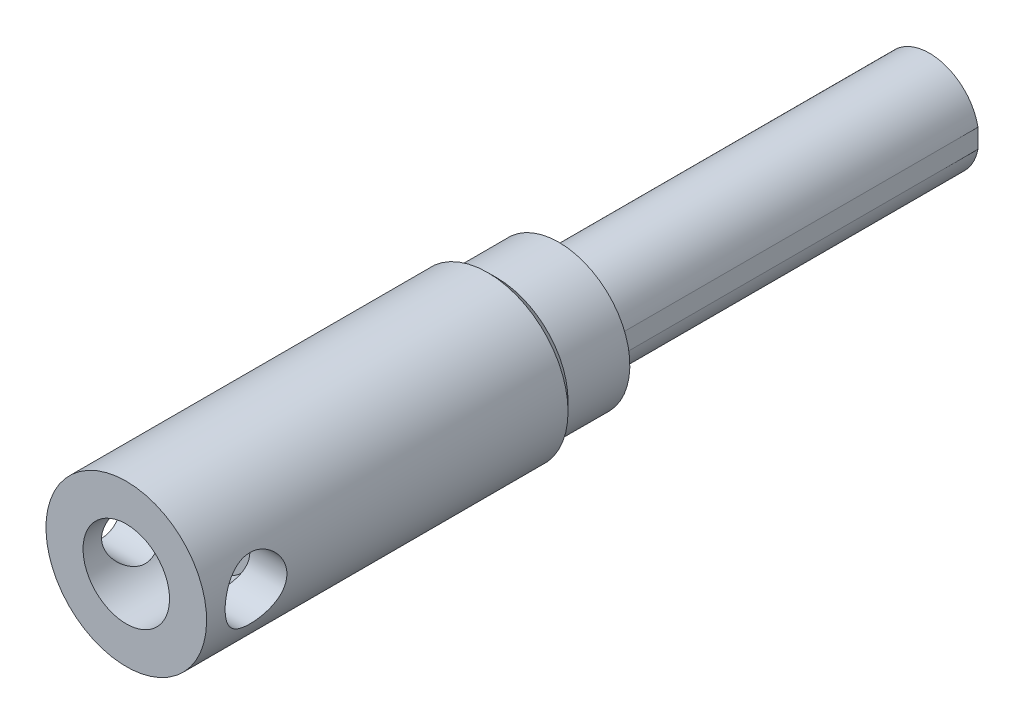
ISO-10303-21;
HEADER;
FILE_DESCRIPTION(('STEP AP214'),'2;1');
FILE_NAME('part.step','',(''),(''),'','','');
FILE_SCHEMA(('AUTOMOTIVE_DESIGN { 1 0 10303 214 1 1 1 1 }'));
ENDSEC;
DATA;
#1=APPLICATION_CONTEXT('core data for automotive mechanical design processes');
#2=APPLICATION_PROTOCOL_DEFINITION('international standard','automotive_design',2000,#1);
#3=PRODUCT_CONTEXT('',#1,'mechanical');
#4=PRODUCT('Part','Part','',(#3));
#5=PRODUCT_RELATED_PRODUCT_CATEGORY('part','',(#4));
#6=PRODUCT_DEFINITION_FORMATION('','',#4);
#7=PRODUCT_DEFINITION_CONTEXT('part definition',#1,'design');
#8=PRODUCT_DEFINITION('design','',#6,#7);
#9=PRODUCT_DEFINITION_SHAPE('','',#8);
#10=(LENGTH_UNIT() NAMED_UNIT(*) SI_UNIT(.MILLI.,.METRE.));
#11=(NAMED_UNIT(*) PLANE_ANGLE_UNIT() SI_UNIT($,.RADIAN.));
#12=(NAMED_UNIT(*) SI_UNIT($,.STERADIAN.) SOLID_ANGLE_UNIT());
#13=UNCERTAINTY_MEASURE_WITH_UNIT(LENGTH_MEASURE(1.E-05),#10,'distance_accuracy_value','');
#14=(GEOMETRIC_REPRESENTATION_CONTEXT(3) GLOBAL_UNCERTAINTY_ASSIGNED_CONTEXT((#13)) GLOBAL_UNIT_ASSIGNED_CONTEXT((#10,
#11,#12)) REPRESENTATION_CONTEXT('',''));
#15=CARTESIAN_POINT('',(0.,0.,0.));
#16=DIRECTION('',(0.,0.,1.));
#17=DIRECTION('',(1.,0.,0.));
#18=AXIS2_PLACEMENT_3D('',#15,#16,#17);
#19=CARTESIAN_POINT('',(-3.46410161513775,0.,112.));
#20=DIRECTION('',(0.866025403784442,-0.5,0.));
#21=DIRECTION('',(0.5,0.866025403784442,0.));
#22=AXIS2_PLACEMENT_3D('',#19,#20,#21);
#23=PLANE('',#22);
#24=DIRECTION('',(0.,0.,1.));
#25=VECTOR('',#24,1.);
#26=CARTESIAN_POINT('',(-1.73205080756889,3.,112.));
#27=LINE('',#26,#25);
#28=CARTESIAN_POINT('',(-1.73205080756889,3.,112.));
#29=VERTEX_POINT('',#28);
#30=CARTESIAN_POINT('',(-1.73205080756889,3.,116.));
#31=VERTEX_POINT('',#30);
#32=EDGE_CURVE('E291',#29,#31,#27,.T.);
#33=ORIENTED_EDGE('',*,*,#32,.T.);
#34=DIRECTION('',(0.5,0.866025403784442,0.));
#35=VECTOR('',#34,1.);
#36=CARTESIAN_POINT('',(-3.46410161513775,0.,116.));
#37=LINE('',#36,#35);
#38=CARTESIAN_POINT('',(-3.46410161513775,0.,116.));
#39=VERTEX_POINT('',#38);
#40=EDGE_CURVE('E29',#39,#31,#37,.T.);
#41=ORIENTED_EDGE('',*,*,#40,.F.);
#42=DIRECTION('',(0.,0.,1.));
#43=VECTOR('',#42,1.);
#44=CARTESIAN_POINT('',(-3.46410161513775,0.,112.));
#45=LINE('',#44,#43);
#46=CARTESIAN_POINT('',(-3.46410161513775,0.,112.));
#47=VERTEX_POINT('',#46);
#48=EDGE_CURVE('E33',#47,#39,#45,.T.);
#49=ORIENTED_EDGE('',*,*,#48,.F.);
#50=DIRECTION('',(0.5,0.866025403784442,0.));
#51=VECTOR('',#50,1.);
#52=CARTESIAN_POINT('',(-3.46410161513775,0.,112.));
#53=LINE('',#52,#51);
#54=EDGE_CURVE('E252',#47,#29,#53,.T.);
#55=ORIENTED_EDGE('',*,*,#54,.T.);
#56=EDGE_LOOP('',(#33,#41,#49,#55));
#57=FACE_BOUND('',#56,.T.);
#58=ADVANCED_FACE('F14',(#57),#23,.T.);
#59=CARTESIAN_POINT('',(1.73205080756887,3.,112.));
#60=DIRECTION('',(0.,1.,0.));
#61=DIRECTION('',(0.,0.,-1.));
#62=AXIS2_PLACEMENT_3D('',#59,#60,#61);
#63=PLANE('',#62);
#64=DIRECTION('',(0.,0.,1.));
#65=VECTOR('',#64,1.);
#66=CARTESIAN_POINT('',(1.73205080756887,3.,112.));
#67=LINE('',#66,#65);
#68=CARTESIAN_POINT('',(1.73205080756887,3.,112.));
#69=VERTEX_POINT('',#68);
#70=CARTESIAN_POINT('',(1.73205080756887,3.,116.));
#71=VERTEX_POINT('',#70);
#72=EDGE_CURVE('E289',#69,#71,#67,.T.);
#73=ORIENTED_EDGE('',*,*,#72,.T.);
#74=DIRECTION('',(-1.,0.,0.));
#75=VECTOR('',#74,1.);
#76=CARTESIAN_POINT('',(1.73205080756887,3.,116.));
#77=LINE('',#76,#75);
#78=EDGE_CURVE('E262',#71,#31,#77,.T.);
#79=ORIENTED_EDGE('',*,*,#78,.T.);
#80=ORIENTED_EDGE('',*,*,#32,.F.);
#81=DIRECTION('',(-1.,0.,0.));
#82=VECTOR('',#81,1.);
#83=CARTESIAN_POINT('',(1.73205080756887,3.,112.));
#84=LINE('',#83,#82);
#85=EDGE_CURVE('E278',#69,#29,#84,.T.);
#86=ORIENTED_EDGE('',*,*,#85,.F.);
#87=EDGE_LOOP('',(#73,#79,#80,#86));
#88=FACE_BOUND('',#87,.T.);
#89=ADVANCED_FACE('F166',(#88),#63,.F.);
#90=CARTESIAN_POINT('',(3.46410161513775,0.,112.));
#91=DIRECTION('',(0.866025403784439,0.5,0.));
#92=DIRECTION('',(-0.5,0.866025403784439,0.));
#93=AXIS2_PLACEMENT_3D('',#90,#91,#92);
#94=PLANE('',#93);
#95=DIRECTION('',(0.,0.,1.));
#96=VECTOR('',#95,1.);
#97=CARTESIAN_POINT('',(3.46410161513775,0.,112.));
#98=LINE('',#97,#96);
#99=CARTESIAN_POINT('',(3.46410161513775,0.,112.));
#100=VERTEX_POINT('',#99);
#101=CARTESIAN_POINT('',(3.46410161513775,0.,116.));
#102=VERTEX_POINT('',#101);
#103=EDGE_CURVE('E287',#100,#102,#98,.T.);
#104=ORIENTED_EDGE('',*,*,#103,.T.);
#105=DIRECTION('',(-0.5,0.866025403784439,0.));
#106=VECTOR('',#105,1.);
#107=CARTESIAN_POINT('',(3.46410161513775,0.,116.));
#108=LINE('',#107,#106);
#109=EDGE_CURVE('E259',#102,#71,#108,.T.);
#110=ORIENTED_EDGE('',*,*,#109,.T.);
#111=ORIENTED_EDGE('',*,*,#72,.F.);
#112=DIRECTION('',(-0.5,0.866025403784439,0.));
#113=VECTOR('',#112,1.);
#114=CARTESIAN_POINT('',(3.46410161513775,0.,112.));
#115=LINE('',#114,#113);
#116=EDGE_CURVE('E275',#100,#69,#115,.T.);
#117=ORIENTED_EDGE('',*,*,#116,.F.);
#118=EDGE_LOOP('',(#104,#110,#111,#117));
#119=FACE_BOUND('',#118,.T.);
#120=ADVANCED_FACE('F171',(#119),#94,.F.);
#121=CARTESIAN_POINT('',(3.46410161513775,0.,112.));
#122=DIRECTION('',(-0.866025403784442,0.5,0.));
#123=DIRECTION('',(-0.5,-0.866025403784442,0.));
#124=AXIS2_PLACEMENT_3D('',#121,#122,#123);
#125=PLANE('',#124);
#126=DIRECTION('',(0.,0.,1.));
#127=VECTOR('',#126,1.);
#128=CARTESIAN_POINT('',(1.73205080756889,-3.,112.));
#129=LINE('',#128,#127);
#130=CARTESIAN_POINT('',(1.73205080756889,-3.,112.));
#131=VERTEX_POINT('',#130);
#132=CARTESIAN_POINT('',(1.73205080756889,-3.,116.));
#133=VERTEX_POINT('',#132);
#134=EDGE_CURVE('E285',#131,#133,#129,.T.);
#135=ORIENTED_EDGE('',*,*,#134,.T.);
#136=DIRECTION('',(-0.5,-0.866025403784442,0.));
#137=VECTOR('',#136,1.);
#138=CARTESIAN_POINT('',(3.46410161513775,0.,116.));
#139=LINE('',#138,#137);
#140=EDGE_CURVE('E256',#102,#133,#139,.T.);
#141=ORIENTED_EDGE('',*,*,#140,.F.);
#142=ORIENTED_EDGE('',*,*,#103,.F.);
#143=DIRECTION('',(-0.5,-0.866025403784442,0.));
#144=VECTOR('',#143,1.);
#145=CARTESIAN_POINT('',(3.46410161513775,0.,112.));
#146=LINE('',#145,#144);
#147=EDGE_CURVE('E272',#100,#131,#146,.T.);
#148=ORIENTED_EDGE('',*,*,#147,.T.);
#149=EDGE_LOOP('',(#135,#141,#142,#148));
#150=FACE_BOUND('',#149,.T.);
#151=ADVANCED_FACE('F184',(#150),#125,.T.);
#152=CARTESIAN_POINT('',(-1.73205080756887,-3.,112.));
#153=DIRECTION('',(0.,-1.,0.));
#154=DIRECTION('',(1.,0.,0.));
#155=AXIS2_PLACEMENT_3D('',#152,#153,#154);
#156=PLANE('',#155);
#157=DIRECTION('',(0.,0.,1.));
#158=VECTOR('',#157,1.);
#159=CARTESIAN_POINT('',(-1.73205080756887,-3.,112.));
#160=LINE('',#159,#158);
#161=CARTESIAN_POINT('',(-1.73205080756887,-3.,112.));
#162=VERTEX_POINT('',#161);
#163=CARTESIAN_POINT('',(-1.73205080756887,-3.,116.));
#164=VERTEX_POINT('',#163);
#165=EDGE_CURVE('E283',#162,#164,#160,.T.);
#166=ORIENTED_EDGE('',*,*,#165,.T.);
#167=DIRECTION('',(1.,0.,0.));
#168=VECTOR('',#167,1.);
#169=CARTESIAN_POINT('',(-1.73205080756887,-3.,116.));
#170=LINE('',#169,#168);
#171=EDGE_CURVE('E253',#164,#133,#170,.T.);
#172=ORIENTED_EDGE('',*,*,#171,.T.);
#173=ORIENTED_EDGE('',*,*,#134,.F.);
#174=DIRECTION('',(1.,0.,0.));
#175=VECTOR('',#174,1.);
#176=CARTESIAN_POINT('',(-1.73205080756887,-3.,112.));
#177=LINE('',#176,#175);
#178=EDGE_CURVE('E269',#162,#131,#177,.T.);
#179=ORIENTED_EDGE('',*,*,#178,.F.);
#180=EDGE_LOOP('',(#166,#172,#173,#179));
#181=FACE_BOUND('',#180,.T.);
#182=ADVANCED_FACE('F180',(#181),#156,.F.);
#183=CARTESIAN_POINT('',(-3.46410161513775,0.,112.));
#184=DIRECTION('',(-0.866025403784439,-0.5,0.));
#185=DIRECTION('',(0.5,-0.866025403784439,0.));
#186=AXIS2_PLACEMENT_3D('',#183,#184,#185);
#187=PLANE('',#186);
#188=DIRECTION('',(0.5,-0.866025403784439,0.));
#189=VECTOR('',#188,1.);
#190=CARTESIAN_POINT('',(-3.46410161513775,0.,112.));
#191=LINE('',#190,#189);
#192=EDGE_CURVE('E266',#47,#162,#191,.T.);
#193=ORIENTED_EDGE('',*,*,#192,.F.);
#194=ORIENTED_EDGE('',*,*,#48,.T.);
#195=DIRECTION('',(0.5,-0.866025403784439,0.));
#196=VECTOR('',#195,1.);
#197=CARTESIAN_POINT('',(-3.46410161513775,0.,116.));
#198=LINE('',#197,#196);
#199=EDGE_CURVE('E249',#39,#164,#198,.T.);
#200=ORIENTED_EDGE('',*,*,#199,.T.);
#201=ORIENTED_EDGE('',*,*,#165,.F.);
#202=EDGE_LOOP('',(#193,#194,#200,#201));
#203=FACE_BOUND('',#202,.T.);
#204=ADVANCED_FACE('F177',(#203),#187,.F.);
#205=CARTESIAN_POINT('',(-5.19615242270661,-3.,112.));
#206=DIRECTION('',(0.,0.,-1.));
#207=DIRECTION('',(0.,-1.,0.));
#208=AXIS2_PLACEMENT_3D('',#205,#206,#207);
#209=PLANE('',#208);
#210=ORIENTED_EDGE('',*,*,#54,.F.);
#211=ORIENTED_EDGE('',*,*,#192,.T.);
#212=ORIENTED_EDGE('',*,*,#178,.T.);
#213=ORIENTED_EDGE('',*,*,#147,.F.);
#214=ORIENTED_EDGE('',*,*,#116,.T.);
#215=ORIENTED_EDGE('',*,*,#85,.T.);
#216=EDGE_LOOP('',(#210,#211,#212,#213,#214,#215));
#217=FACE_BOUND('',#216,.T.);
#218=ADVANCED_FACE('F176',(#217),#209,.F.);
#219=CARTESIAN_POINT('',(0.,0.,116.));
#220=DIRECTION('',(0.,0.,1.));
#221=DIRECTION('',(0.,1.,0.));
#222=AXIS2_PLACEMENT_3D('',#219,#220,#221);
#223=PLANE('',#222);
#224=CARTESIAN_POINT('',(0.,0.,116.));
#225=DIRECTION('',(0.,0.,1.));
#226=DIRECTION('',(0.,1.,0.));
#227=AXIS2_PLACEMENT_3D('',#224,#225,#226);
#228=CIRCLE('',#227,6.5);
#229=CARTESIAN_POINT('',(0.,6.5,116.));
#230=VERTEX_POINT('',#229);
#231=EDGE_CURVE('E9',#230,#230,#228,.T.);
#232=ORIENTED_EDGE('',*,*,#231,.T.);
#233=EDGE_LOOP('',(#232));
#234=FACE_BOUND('',#233,.T.);
#235=ORIENTED_EDGE('',*,*,#199,.F.);
#236=ORIENTED_EDGE('',*,*,#40,.T.);
#237=ORIENTED_EDGE('',*,*,#78,.F.);
#238=ORIENTED_EDGE('',*,*,#109,.F.);
#239=ORIENTED_EDGE('',*,*,#140,.T.);
#240=ORIENTED_EDGE('',*,*,#171,.F.);
#241=EDGE_LOOP('',(#235,#236,#237,#238,#239,#240));
#242=FACE_BOUND('',#241,.T.);
#243=ADVANCED_FACE('F16',(#234,#242),#223,.T.);
#244=CARTESIAN_POINT('',(0.,0.,88.));
#245=DIRECTION('',(0.,0.,1.));
#246=DIRECTION('',(0.,1.,0.));
#247=AXIS2_PLACEMENT_3D('',#244,#245,#246);
#248=CYLINDRICAL_SURFACE('',#247,6.5);
#249=CARTESIAN_POINT('',(0.,0.,108.));
#250=DIRECTION('',(0.,0.,1.));
#251=DIRECTION('',(0.,1.,0.));
#252=AXIS2_PLACEMENT_3D('',#249,#250,#251);
#253=CIRCLE('',#252,6.5);
#254=CARTESIAN_POINT('',(0.,6.5,108.));
#255=VERTEX_POINT('',#254);
#256=EDGE_CURVE('E22',#255,#255,#253,.T.);
#257=ORIENTED_EDGE('',*,*,#256,.T.);
#258=EDGE_LOOP('',(#257));
#259=FACE_BOUND('',#258,.T.);
#260=ORIENTED_EDGE('',*,*,#231,.F.);
#261=EDGE_LOOP('',(#260));
#262=FACE_BOUND('',#261,.T.);
#263=ADVANCED_FACE('F191',(#259,#262),#248,.T.);
#264=CARTESIAN_POINT('',(0.,0.,0.));
#265=DIRECTION('',(0.,0.,1.));
#266=DIRECTION('',(-1.,0.,0.));
#267=AXIS2_PLACEMENT_3D('',#264,#265,#266);
#268=PLANE('',#267);
#269=DIRECTION('',(0.,-1.,0.));
#270=VECTOR('',#269,1.);
#271=CARTESIAN_POINT('',(7.85,-1.54191439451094,0.));
#272=LINE('',#271,#270);
#273=CARTESIAN_POINT('',(7.85,1.54191439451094,0.));
#274=VERTEX_POINT('',#273);
#275=CARTESIAN_POINT('',(7.85,-1.54191439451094,0.));
#276=VERTEX_POINT('',#275);
#277=EDGE_CURVE('E91',#274,#276,#272,.T.);
#278=ORIENTED_EDGE('',*,*,#277,.T.);
#279=CARTESIAN_POINT('',(0.,0.,0.));
#280=DIRECTION('',(0.,0.,1.));
#281=DIRECTION('',(-1.,0.,0.));
#282=AXIS2_PLACEMENT_3D('',#279,#280,#281);
#283=CIRCLE('',#282,8.);
#284=EDGE_CURVE('E83',#274,#276,#283,.T.);
#285=ORIENTED_EDGE('',*,*,#284,.F.);
#286=EDGE_LOOP('',(#278,#285));
#287=FACE_BOUND('',#286,.T.);
#288=ADVANCED_FACE('F95',(#287),#268,.F.);
#289=CARTESIAN_POINT('',(7.85,-1.54191439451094,80.));
#290=DIRECTION('',(1.,0.,0.));
#291=DIRECTION('',(0.,0.,1.));
#292=AXIS2_PLACEMENT_3D('',#289,#290,#291);
#293=PLANE('',#292);
#294=DIRECTION('',(0.,1.,0.));
#295=VECTOR('',#294,1.);
#296=CARTESIAN_POINT('',(7.85,11.5,60.));
#297=LINE('',#296,#295);
#298=CARTESIAN_POINT('',(7.85,-1.54191439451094,60.));
#299=VERTEX_POINT('',#298);
#300=CARTESIAN_POINT('',(7.85,1.54191439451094,60.));
#301=VERTEX_POINT('',#300);
#302=EDGE_CURVE('E246',#299,#301,#297,.T.);
#303=ORIENTED_EDGE('',*,*,#302,.F.);
#304=DIRECTION('',(0.,0.,-1.));
#305=VECTOR('',#304,1.);
#306=CARTESIAN_POINT('',(7.85,-1.54191439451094,80.));
#307=LINE('',#306,#305);
#308=EDGE_CURVE('E88',#299,#276,#307,.T.);
#309=ORIENTED_EDGE('',*,*,#308,.T.);
#310=ORIENTED_EDGE('',*,*,#277,.F.);
#311=DIRECTION('',(0.,0.,-1.));
#312=VECTOR('',#311,1.);
#313=CARTESIAN_POINT('',(7.85,1.54191439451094,80.));
#314=LINE('',#313,#312);
#315=EDGE_CURVE('E78',#301,#274,#314,.T.);
#316=ORIENTED_EDGE('',*,*,#315,.F.);
#317=EDGE_LOOP('',(#303,#309,#310,#316));
#318=FACE_BOUND('',#317,.T.);
#319=ADVANCED_FACE('F92',(#318),#293,.T.);
#320=CARTESIAN_POINT('',(0.,0.,80.));
#321=DIRECTION('',(0.,0.,-1.));
#322=DIRECTION('',(1.,0.,0.));
#323=AXIS2_PLACEMENT_3D('',#320,#321,#322);
#324=CYLINDRICAL_SURFACE('',#323,8.);
#325=ORIENTED_EDGE('',*,*,#308,.F.);
#326=CARTESIAN_POINT('',(0.,0.,60.));
#327=DIRECTION('',(0.,0.,1.));
#328=DIRECTION('',(1.02551700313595E-09,-1.,0.));
#329=AXIS2_PLACEMENT_3D('',#326,#327,#328);
#330=CIRCLE('',#329,8.);
#331=EDGE_CURVE('E84',#299,#301,#330,.F.);
#332=ORIENTED_EDGE('',*,*,#331,.T.);
#333=ORIENTED_EDGE('',*,*,#315,.T.);
#334=ORIENTED_EDGE('',*,*,#284,.T.);
#335=EDGE_LOOP('',(#325,#332,#333,#334));
#336=FACE_BOUND('',#335,.T.);
#337=ADVANCED_FACE('F81',(#336),#324,.T.);
#338=CARTESIAN_POINT('',(0.,11.5,60.));
#339=DIRECTION('',(0.,0.,1.));
#340=DIRECTION('',(0.,-1.,0.));
#341=AXIS2_PLACEMENT_3D('',#338,#339,#340);
#342=PLANE('',#341);
#343=CARTESIAN_POINT('',(0.,0.,60.));
#344=DIRECTION('',(0.,0.,-1.));
#345=DIRECTION('',(0.,1.,0.));
#346=AXIS2_PLACEMENT_3D('',#343,#344,#345);
#347=CIRCLE('',#346,11.5);
#348=CARTESIAN_POINT('',(0.,11.5,60.));
#349=VERTEX_POINT('',#348);
#350=EDGE_CURVE('E222',#349,#349,#347,.T.);
#351=ORIENTED_EDGE('',*,*,#350,.T.);
#352=EDGE_LOOP('',(#351));
#353=FACE_BOUND('',#352,.T.);
#354=ORIENTED_EDGE('',*,*,#331,.F.);
#355=ORIENTED_EDGE('',*,*,#302,.T.);
#356=EDGE_LOOP('',(#354,#355));
#357=FACE_BOUND('',#356,.T.);
#358=ADVANCED_FACE('F126',(#353,#357),#342,.F.);
#359=CARTESIAN_POINT('',(0.,0.,60.));
#360=DIRECTION('',(0.,0.,-1.));
#361=DIRECTION('',(0.,1.,0.));
#362=AXIS2_PLACEMENT_3D('',#359,#360,#361);
#363=CYLINDRICAL_SURFACE('',#362,11.5);
#364=ORIENTED_EDGE('',*,*,#350,.F.);
#365=EDGE_LOOP('',(#364));
#366=FACE_BOUND('',#365,.T.);
#367=CARTESIAN_POINT('',(0.,0.,70.));
#368=DIRECTION('',(0.,0.,-1.));
#369=DIRECTION('',(0.,1.,0.));
#370=AXIS2_PLACEMENT_3D('',#367,#368,#369);
#371=CIRCLE('',#370,11.5);
#372=CARTESIAN_POINT('',(0.,11.5,70.));
#373=VERTEX_POINT('',#372);
#374=EDGE_CURVE('E220',#373,#373,#371,.T.);
#375=ORIENTED_EDGE('',*,*,#374,.T.);
#376=EDGE_LOOP('',(#375));
#377=FACE_BOUND('',#376,.T.);
#378=ADVANCED_FACE('F151',(#366,#377),#363,.T.);
#379=CARTESIAN_POINT('',(0.,0.,70.));
#380=DIRECTION('',(0.,0.,1.));
#381=DIRECTION('',(0.,-1.,0.));
#382=AXIS2_PLACEMENT_3D('',#379,#380,#381);
#383=CONICAL_SURFACE('',#382,11.5,0.785398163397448);
#384=CARTESIAN_POINT('',(0.,0.,71.5));
#385=DIRECTION('',(0.,0.,1.));
#386=DIRECTION('',(0.,-1.,0.));
#387=AXIS2_PLACEMENT_3D('',#384,#385,#386);
#388=CIRCLE('',#387,13.);
#389=CARTESIAN_POINT('',(0.,-13.,71.5));
#390=VERTEX_POINT('',#389);
#391=EDGE_CURVE('E145',#390,#390,#388,.T.);
#392=ORIENTED_EDGE('',*,*,#391,.F.);
#393=EDGE_LOOP('',(#392));
#394=FACE_BOUND('',#393,.T.);
#395=ORIENTED_EDGE('',*,*,#374,.F.);
#396=EDGE_LOOP('',(#395));
#397=FACE_BOUND('',#396,.T.);
#398=ADVANCED_FACE('F124',(#394,#397),#383,.T.);
#399=CARTESIAN_POINT('',(0.,0.,60.));
#400=DIRECTION('',(0.,0.,-1.));
#401=DIRECTION('',(0.,1.,0.));
#402=AXIS2_PLACEMENT_3D('',#399,#400,#401);
#403=CYLINDRICAL_SURFACE('',#402,13.);
#404=ORIENTED_EDGE('',*,*,#391,.T.);
#405=EDGE_LOOP('',(#404));
#406=FACE_BOUND('',#405,.T.);
#407=CARTESIAN_POINT('',(-13.,0.,127.));
#408=CARTESIAN_POINT('',(-13.0000005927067,-0.135105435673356,127.000000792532));
#409=CARTESIAN_POINT('',(-12.9978893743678,-0.270200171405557,126.994519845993));
#410=CARTESIAN_POINT('',(-12.9895020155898,-0.539422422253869,126.972651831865));
#411=CARTESIAN_POINT('',(-12.9832245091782,-0.673549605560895,126.956261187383));
#412=CARTESIAN_POINT('',(-12.9666767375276,-0.939715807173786,126.912749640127));
#413=CARTESIAN_POINT('',(-12.9564088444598,-1.07175601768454,126.885635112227));
#414=CARTESIAN_POINT('',(-12.9321488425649,-1.33294373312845,126.820930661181));
#415=CARTESIAN_POINT('',(-12.9181552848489,-1.4620900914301,126.783336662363));
#416=CARTESIAN_POINT('',(-12.8868451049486,-1.71626719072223,126.698121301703));
#417=CARTESIAN_POINT('',(-12.8695366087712,-1.84130713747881,126.650524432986));
#418=CARTESIAN_POINT('',(-12.832015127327,-2.08682707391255,126.545657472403));
#419=CARTESIAN_POINT('',(-12.8118010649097,-2.2073053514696,126.488383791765));
#420=CARTESIAN_POINT('',(-12.7475355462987,-2.56075981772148,126.302698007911));
#421=CARTESIAN_POINT('',(-12.6998359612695,-2.78594772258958,126.160356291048));
#422=CARTESIAN_POINT('',(-12.5973130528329,-3.21857896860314,125.836254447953));
#423=CARTESIAN_POINT('',(-12.5422812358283,-3.42495370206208,125.653146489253));
#424=CARTESIAN_POINT('',(-12.432249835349,-3.80503922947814,125.255341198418));
#425=CARTESIAN_POINT('',(-12.3772502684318,-3.97873925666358,125.04063349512));
#426=CARTESIAN_POINT('',(-12.2981799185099,-4.21450431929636,124.694180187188));
#427=CARTESIAN_POINT('',(-12.2719168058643,-4.29018004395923,124.57197767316));
#428=CARTESIAN_POINT('',(-12.221810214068,-4.43090570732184,124.321146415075));
#429=CARTESIAN_POINT('',(-12.1979657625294,-4.49595992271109,124.192520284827));
#430=CARTESIAN_POINT('',(-12.1534684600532,-4.61489357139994,123.929657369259));
#431=CARTESIAN_POINT('',(-12.1328159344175,-4.66877186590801,123.795420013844));
#432=CARTESIAN_POINT('',(-12.095423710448,-4.76480665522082,123.522349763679));
#433=CARTESIAN_POINT('',(-12.0786820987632,-4.80696888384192,123.383519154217));
#434=CARTESIAN_POINT('',(-12.0503198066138,-4.87762040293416,123.108220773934));
#435=CARTESIAN_POINT('',(-12.0385125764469,-4.90661231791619,122.971901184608));
#436=CARTESIAN_POINT('',(-12.0194473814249,-4.95313223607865,122.697061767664));
#437=CARTESIAN_POINT('',(-12.0121874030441,-4.97066531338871,122.558542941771));
#438=CARTESIAN_POINT('',(-12.0024704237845,-4.99408302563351,122.280379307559));
#439=CARTESIAN_POINT('',(-12.0000125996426,-4.99996965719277,122.140734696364));
#440=CARTESIAN_POINT('',(-11.9999874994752,-5.00003010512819,121.861445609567));
#441=CARTESIAN_POINT('',(-12.0024200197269,-4.99420440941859,121.721801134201));
#442=CARTESIAN_POINT('',(-12.0117767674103,-4.97165500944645,121.452532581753));
#443=CARTESIAN_POINT('',(-12.0184047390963,-4.95564978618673,121.322837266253));
#444=CARTESIAN_POINT('',(-12.0356604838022,-4.91359264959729,121.06531480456));
#445=CARTESIAN_POINT('',(-12.0462895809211,-4.88753741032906,120.937488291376));
#446=CARTESIAN_POINT('',(-12.0712213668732,-4.82563229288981,120.684627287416));
#447=CARTESIAN_POINT('',(-12.0855231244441,-4.78978489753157,120.559592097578));
#448=CARTESIAN_POINT('',(-12.1173774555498,-4.70861515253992,120.313045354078));
#449=CARTESIAN_POINT('',(-12.1349312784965,-4.66328916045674,120.191535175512));
#450=CARTESIAN_POINT('',(-12.1924755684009,-4.51169850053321,119.828828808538));
#451=CARTESIAN_POINT('',(-12.2368566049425,-4.39098115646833,119.594180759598));
#452=CARTESIAN_POINT('',(-12.3323705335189,-4.11508008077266,119.14778516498));
#453=CARTESIAN_POINT('',(-12.3835058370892,-3.95988402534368,118.936045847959));
#454=CARTESIAN_POINT('',(-12.4912059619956,-3.60641390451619,118.525493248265));
#455=CARTESIAN_POINT('',(-12.547898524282,-3.40586385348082,118.32866466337));
#456=CARTESIAN_POINT('',(-12.6572139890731,-2.97397181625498,117.970835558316));
#457=CARTESIAN_POINT('',(-12.7098361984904,-2.74262460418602,117.809841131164));
#458=CARTESIAN_POINT('',(-12.8062280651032,-2.25041847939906,117.525890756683));
#459=CARTESIAN_POINT('',(-12.849831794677,-1.98912426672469,117.403628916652));
#460=CARTESIAN_POINT('',(-12.9220340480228,-1.44757926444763,117.205467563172));
#461=CARTESIAN_POINT('',(-12.9506395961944,-1.16733741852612,117.12954634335));
#462=CARTESIAN_POINT('',(-12.9883704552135,-0.612551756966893,117.030115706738));
#463=CARTESIAN_POINT('',(-12.9984884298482,-0.338554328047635,117.003932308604));
#464=CARTESIAN_POINT('',(-13.0011941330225,0.2100760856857,116.996893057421));
#465=CARTESIAN_POINT('',(-12.9937859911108,0.484708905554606,117.016026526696));
#466=CARTESIAN_POINT('',(-12.9629250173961,1.01504689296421,117.097070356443));
#467=CARTESIAN_POINT('',(-12.9401399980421,1.27106696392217,117.157201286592));
#468=CARTESIAN_POINT('',(-12.8814960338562,1.7691818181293,117.316157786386));
#469=CARTESIAN_POINT('',(-12.8456353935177,2.01127479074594,117.414988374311));
#470=CARTESIAN_POINT('',(-12.7630227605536,2.48279681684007,117.651737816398));
#471=CARTESIAN_POINT('',(-12.7159770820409,2.71163049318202,117.790737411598));
#472=CARTESIAN_POINT('',(-12.6161681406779,3.1434885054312,118.102624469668));
#473=CARTESIAN_POINT('',(-12.5634026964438,3.34650292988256,118.275524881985));
#474=CARTESIAN_POINT('',(-12.4539121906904,3.73404077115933,118.662878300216));
#475=CARTESIAN_POINT('',(-12.3971420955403,3.91667798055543,118.879223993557));
#476=CARTESIAN_POINT('',(-12.3161782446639,4.16163312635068,119.224959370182));
#477=CARTESIAN_POINT('',(-12.289873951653,4.23848974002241,119.343820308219));
#478=CARTESIAN_POINT('',(-12.2394322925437,4.38201692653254,119.587958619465));
#479=CARTESIAN_POINT('',(-12.2152940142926,4.44869179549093,119.713233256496));
#480=CARTESIAN_POINT('',(-12.1697850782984,4.57172493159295,119.97027707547));
#481=CARTESIAN_POINT('',(-12.1484337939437,4.62801200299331,120.10208375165));
#482=CARTESIAN_POINT('',(-12.1094072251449,4.729185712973,120.370473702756));
#483=CARTESIAN_POINT('',(-12.091730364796,4.77407724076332,120.50705490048));
#484=CARTESIAN_POINT('',(-12.060669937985,4.85201021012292,120.783989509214));
#485=CARTESIAN_POINT('',(-12.0472849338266,4.88505562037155,120.924341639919));
#486=CARTESIAN_POINT('',(-12.0252955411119,4.93893894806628,121.207736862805));
#487=CARTESIAN_POINT('',(-12.0166907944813,4.95977777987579,121.3507797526));
#488=CARTESIAN_POINT('',(-12.0049970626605,4.98801162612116,121.628641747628));
#489=CARTESIAN_POINT('',(-12.0015752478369,4.99621847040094,121.763364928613));
#490=CARTESIAN_POINT('',(-11.9992876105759,5.0017104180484,122.033121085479));
#491=CARTESIAN_POINT('',(-12.0004233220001,4.99899184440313,122.16815415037));
#492=CARTESIAN_POINT('',(-12.0072143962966,4.9826578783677,122.437377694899));
#493=CARTESIAN_POINT('',(-12.0128675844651,4.96904772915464,122.571568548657));
#494=CARTESIAN_POINT('',(-12.0285026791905,4.93107933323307,122.838213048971));
#495=CARTESIAN_POINT('',(-12.0384862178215,4.90671703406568,122.970666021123));
#496=CARTESIAN_POINT('',(-12.0620452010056,4.84850652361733,123.228341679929));
#497=CARTESIAN_POINT('',(-12.0754859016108,4.8150118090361,123.353656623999));
#498=CARTESIAN_POINT('',(-12.1057001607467,4.73853416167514,123.600960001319));
#499=CARTESIAN_POINT('',(-12.1224749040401,4.69554785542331,123.722947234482));
#500=CARTESIAN_POINT('',(-12.1771051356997,4.55286045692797,124.082766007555));
#501=CARTESIAN_POINT('',(-12.2192851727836,4.43938737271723,124.314645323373));
#502=CARTESIAN_POINT('',(-12.3132307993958,4.17198360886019,124.769103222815));
#503=CARTESIAN_POINT('',(-12.3653926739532,4.01618977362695,124.990492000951));
#504=CARTESIAN_POINT('',(-12.4721601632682,3.67120048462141,125.405133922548));
#505=CARTESIAN_POINT('',(-12.5267665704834,3.48199413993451,125.598377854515));
#506=CARTESIAN_POINT('',(-12.6079253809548,3.17059659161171,125.8688191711));
#507=CARTESIAN_POINT('',(-12.6355919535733,3.05874516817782,125.957846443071));
#508=CARTESIAN_POINT('',(-12.6893179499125,2.82758971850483,126.126153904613));
#509=CARTESIAN_POINT('',(-12.7153779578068,2.70828843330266,126.205437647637));
#510=CARTESIAN_POINT('',(-12.7651818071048,2.46288880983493,126.353705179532));
#511=CARTESIAN_POINT('',(-12.788924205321,2.3367863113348,126.42268256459));
#512=CARTESIAN_POINT('',(-12.833394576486,2.07872954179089,126.549676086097));
#513=CARTESIAN_POINT('',(-12.8541238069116,1.94677774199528,126.607696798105));
#514=CARTESIAN_POINT('',(-12.8932221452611,1.66905616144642,126.715705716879));
#515=CARTESIAN_POINT('',(-12.9113467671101,1.52294807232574,126.764915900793));
#516=CARTESIAN_POINT('',(-12.9428888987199,1.22632421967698,126.849734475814));
#517=CARTESIAN_POINT('',(-12.956306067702,1.07580813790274,126.885341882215));
#518=CARTESIAN_POINT('',(-12.9779612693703,0.771832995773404,126.942487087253));
#519=CARTESIAN_POINT('',(-12.9862017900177,0.618375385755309,126.964031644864));
#520=CARTESIAN_POINT('',(-12.9972204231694,0.309940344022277,126.992786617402));
#521=CARTESIAN_POINT('',(-12.9999993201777,0.154963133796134,126.999999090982));
#522=CARTESIAN_POINT('',(-13.,0.,127.));
#523=B_SPLINE_CURVE_WITH_KNOTS('',3,(#407,#408,#409,#410,#411,#412,#413,#414,#415,#416,#417,
#418,#419,#420,#421,#422,#423,#424,#425,#426,#427,#428,#429,#430,#431,#432,#433,#434,#435,#436,
#437,#438,#439,#440,#441,#442,#443,#444,#445,#446,#447,#448,#449,#450,#451,#452,#453,#454,#455,
#456,#457,#458,#459,#460,#461,#462,#463,#464,#465,#466,#467,#468,#469,#470,#471,#472,#473,#474,
#475,#476,#477,#478,#479,#480,#481,#482,#483,#484,#485,#486,#487,#488,#489,#490,#491,#492,#493,
#494,#495,#496,#497,#498,#499,#500,#501,#502,#503,#504,#505,#506,#507,#508,#509,#510,#511,#512,
#513,#514,#515,#516,#517,#518,#519,#520,#521,#522),.UNSPECIFIED.,.T.,.F.,(4,2,2,2,2,2,2,2,2,2,2,
2,2,2,2,2,2,2,2,2,2,2,2,2,2,2,2,2,2,2,2,2,2,2,2,2,2,2,2,2,2,2,2,2,2,2,2,2,2,2,2,2,2,2,2,2,2,4),
(0.,0.40517084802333,0.810474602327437,1.21553778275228,1.6207587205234,2.02499875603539,
2.42938903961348,3.23756407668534,4.07803275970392,4.91877790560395,5.35667473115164,
5.79439480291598,6.23215945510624,6.66970948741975,7.08876415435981,7.50763313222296,
7.92643029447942,8.3452100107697,8.73729047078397,9.12950079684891,9.52161176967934,
9.91387370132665,10.7128942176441,11.5122007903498,12.3682501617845,13.224444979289,
14.0952133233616,14.9655734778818,15.7876487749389,16.6095303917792,17.39783692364,
18.1862457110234,18.9982364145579,19.8105378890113,20.6724430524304,21.103926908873,
21.5352281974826,21.9693838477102,22.4033529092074,22.837176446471,23.2709674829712,
23.6755054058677,24.0801794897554,24.4846588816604,24.8892908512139,25.2800632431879,
25.6709747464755,26.4522151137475,27.2759013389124,28.0998565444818,28.536246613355,
28.9724770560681,29.4089774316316,29.8452951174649,30.3102744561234,30.7752874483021,
31.2400767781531,31.7047993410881),.UNSPECIFIED.);
#524=CARTESIAN_POINT('',(-13.,0.,127.));
#525=VERTEX_POINT('',#524);
#526=EDGE_CURVE('E139',#525,#525,#523,.T.);
#527=ORIENTED_EDGE('',*,*,#526,.T.);
#528=EDGE_LOOP('',(#527));
#529=FACE_BOUND('',#528,.T.);
#530=CARTESIAN_POINT('',(13.,0.,127.));
#531=CARTESIAN_POINT('',(13.0000005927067,0.135105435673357,127.000000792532));
#532=CARTESIAN_POINT('',(12.9978893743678,0.270200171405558,126.994519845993));
#533=CARTESIAN_POINT('',(12.9895020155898,0.539422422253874,126.972651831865));
#534=CARTESIAN_POINT('',(12.9832245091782,0.673549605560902,126.956261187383));
#535=CARTESIAN_POINT('',(12.9666767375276,0.939715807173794,126.912749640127));
#536=CARTESIAN_POINT('',(12.9564088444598,1.07175601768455,126.885635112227));
#537=CARTESIAN_POINT('',(12.9321488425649,1.33294373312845,126.820930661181));
#538=CARTESIAN_POINT('',(12.9181552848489,1.4620900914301,126.783336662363));
#539=CARTESIAN_POINT('',(12.8868451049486,1.71626719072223,126.698121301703));
#540=CARTESIAN_POINT('',(12.8695366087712,1.84130713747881,126.650524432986));
#541=CARTESIAN_POINT('',(12.832015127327,2.08682707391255,126.545657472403));
#542=CARTESIAN_POINT('',(12.8118010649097,2.2073053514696,126.488383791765));
#543=CARTESIAN_POINT('',(12.7475355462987,2.56075981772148,126.302698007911));
#544=CARTESIAN_POINT('',(12.6998359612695,2.78594772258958,126.160356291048));
#545=CARTESIAN_POINT('',(12.5973130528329,3.21857896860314,125.836254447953));
#546=CARTESIAN_POINT('',(12.5422812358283,3.42495370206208,125.653146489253));
#547=CARTESIAN_POINT('',(12.432249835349,3.80503922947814,125.255341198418));
#548=CARTESIAN_POINT('',(12.3772502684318,3.97873925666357,125.04063349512));
#549=CARTESIAN_POINT('',(12.2981799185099,4.21450431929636,124.694180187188));
#550=CARTESIAN_POINT('',(12.2719168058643,4.29018004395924,124.57197767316));
#551=CARTESIAN_POINT('',(12.221810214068,4.43090570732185,124.321146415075));
#552=CARTESIAN_POINT('',(12.1979657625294,4.49595992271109,124.192520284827));
#553=CARTESIAN_POINT('',(12.1534684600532,4.61489357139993,123.929657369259));
#554=CARTESIAN_POINT('',(12.1328159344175,4.668771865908,123.795420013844));
#555=CARTESIAN_POINT('',(12.095423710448,4.76480665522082,123.522349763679));
#556=CARTESIAN_POINT('',(12.0786820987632,4.80696888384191,123.383519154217));
#557=CARTESIAN_POINT('',(12.0503198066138,4.87762040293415,123.108220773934));
#558=CARTESIAN_POINT('',(12.0385125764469,4.90661231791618,122.971901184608));
#559=CARTESIAN_POINT('',(12.0194473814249,4.95313223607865,122.697061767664));
#560=CARTESIAN_POINT('',(12.0121874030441,4.97066531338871,122.558542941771));
#561=CARTESIAN_POINT('',(12.0024704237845,4.99408302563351,122.280379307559));
#562=CARTESIAN_POINT('',(12.0000125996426,4.99996965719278,122.140734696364));
#563=CARTESIAN_POINT('',(11.9999874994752,5.00003010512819,121.861445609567));
#564=CARTESIAN_POINT('',(12.0024200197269,4.99420440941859,121.721801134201));
#565=CARTESIAN_POINT('',(12.0117767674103,4.97165500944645,121.452532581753));
#566=CARTESIAN_POINT('',(12.0184047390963,4.95564978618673,121.322837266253));
#567=CARTESIAN_POINT('',(12.0356604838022,4.91359264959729,121.06531480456));
#568=CARTESIAN_POINT('',(12.0462895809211,4.88753741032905,120.937488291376));
#569=CARTESIAN_POINT('',(12.0712213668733,4.82563229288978,120.684627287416));
#570=CARTESIAN_POINT('',(12.0855231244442,4.78978489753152,120.559592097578));
#571=CARTESIAN_POINT('',(12.1173774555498,4.70861515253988,120.313045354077));
#572=CARTESIAN_POINT('',(12.1349312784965,4.66328916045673,120.191535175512));
#573=CARTESIAN_POINT('',(12.1924755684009,4.51169850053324,119.828828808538));
#574=CARTESIAN_POINT('',(12.2368566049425,4.3909811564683,119.594180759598));
#575=CARTESIAN_POINT('',(12.3323705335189,4.1150800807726,119.14778516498));
#576=CARTESIAN_POINT('',(12.3835058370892,3.95988402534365,118.936045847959));
#577=CARTESIAN_POINT('',(12.4912059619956,3.60641390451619,118.525493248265));
#578=CARTESIAN_POINT('',(12.547898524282,3.40586385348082,118.32866466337));
#579=CARTESIAN_POINT('',(12.6572139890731,2.97397181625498,117.970835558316));
#580=CARTESIAN_POINT('',(12.7098361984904,2.74262460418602,117.809841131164));
#581=CARTESIAN_POINT('',(12.8062280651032,2.25041847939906,117.525890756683));
#582=CARTESIAN_POINT('',(12.849831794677,1.9891242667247,117.403628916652));
#583=CARTESIAN_POINT('',(12.9220340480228,1.44757926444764,117.205467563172));
#584=CARTESIAN_POINT('',(12.9506395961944,1.16733741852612,117.12954634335));
#585=CARTESIAN_POINT('',(12.9883704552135,0.612551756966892,117.030115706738));
#586=CARTESIAN_POINT('',(12.9984884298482,0.338554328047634,117.003932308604));
#587=CARTESIAN_POINT('',(13.0011941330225,-0.210076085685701,116.996893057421));
#588=CARTESIAN_POINT('',(12.9937859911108,-0.484708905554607,117.016026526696));
#589=CARTESIAN_POINT('',(12.9629250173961,-1.01504689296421,117.097070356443));
#590=CARTESIAN_POINT('',(12.9401399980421,-1.27106696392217,117.157201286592));
#591=CARTESIAN_POINT('',(12.8814960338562,-1.7691818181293,117.316157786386));
#592=CARTESIAN_POINT('',(12.8456353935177,-2.01127479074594,117.414988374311));
#593=CARTESIAN_POINT('',(12.7630227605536,-2.48279681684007,117.651737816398));
#594=CARTESIAN_POINT('',(12.7159770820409,-2.71163049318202,117.790737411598));
#595=CARTESIAN_POINT('',(12.6161681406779,-3.1434885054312,118.102624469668));
#596=CARTESIAN_POINT('',(12.5634026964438,-3.34650292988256,118.275524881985));
#597=CARTESIAN_POINT('',(12.4539121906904,-3.73404077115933,118.662878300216));
#598=CARTESIAN_POINT('',(12.3971420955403,-3.91667798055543,118.879223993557));
#599=CARTESIAN_POINT('',(12.3161782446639,-4.16163312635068,119.224959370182));
#600=CARTESIAN_POINT('',(12.289873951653,-4.23848974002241,119.343820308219));
#601=CARTESIAN_POINT('',(12.2394322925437,-4.38201692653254,119.587958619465));
#602=CARTESIAN_POINT('',(12.2152940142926,-4.44869179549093,119.713233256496));
#603=CARTESIAN_POINT('',(12.1697850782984,-4.57172493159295,119.97027707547));
#604=CARTESIAN_POINT('',(12.1484337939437,-4.62801200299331,120.10208375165));
#605=CARTESIAN_POINT('',(12.1094072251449,-4.729185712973,120.370473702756));
#606=CARTESIAN_POINT('',(12.091730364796,-4.77407724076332,120.50705490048));
#607=CARTESIAN_POINT('',(12.060669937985,-4.85201021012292,120.783989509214));
#608=CARTESIAN_POINT('',(12.0472849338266,-4.88505562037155,120.924341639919));
#609=CARTESIAN_POINT('',(12.0252955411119,-4.93893894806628,121.207736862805));
#610=CARTESIAN_POINT('',(12.0166907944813,-4.95977777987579,121.3507797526));
#611=CARTESIAN_POINT('',(12.0049970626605,-4.98801162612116,121.628641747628));
#612=CARTESIAN_POINT('',(12.0015752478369,-4.99621847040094,121.763364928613));
#613=CARTESIAN_POINT('',(11.9992876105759,-5.0017104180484,122.033121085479));
#614=CARTESIAN_POINT('',(12.0004233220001,-4.99899184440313,122.16815415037));
#615=CARTESIAN_POINT('',(12.0072143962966,-4.9826578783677,122.437377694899));
#616=CARTESIAN_POINT('',(12.0128675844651,-4.96904772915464,122.571568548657));
#617=CARTESIAN_POINT('',(12.0285026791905,-4.93107933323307,122.838213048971));
#618=CARTESIAN_POINT('',(12.0384862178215,-4.90671703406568,122.970666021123));
#619=CARTESIAN_POINT('',(12.0620452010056,-4.84850652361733,123.228341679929));
#620=CARTESIAN_POINT('',(12.0754859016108,-4.8150118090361,123.353656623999));
#621=CARTESIAN_POINT('',(12.1057001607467,-4.73853416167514,123.600960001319));
#622=CARTESIAN_POINT('',(12.1224749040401,-4.69554785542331,123.722947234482));
#623=CARTESIAN_POINT('',(12.1771051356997,-4.55286045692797,124.082766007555));
#624=CARTESIAN_POINT('',(12.2192851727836,-4.43938737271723,124.314645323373));
#625=CARTESIAN_POINT('',(12.3132307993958,-4.17198360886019,124.769103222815));
#626=CARTESIAN_POINT('',(12.3653926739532,-4.01618977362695,124.990492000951));
#627=CARTESIAN_POINT('',(12.4721601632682,-3.67120048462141,125.405133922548));
#628=CARTESIAN_POINT('',(12.5267665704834,-3.48199413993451,125.598377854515));
#629=CARTESIAN_POINT('',(12.6079253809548,-3.1705965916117,125.8688191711));
#630=CARTESIAN_POINT('',(12.6355919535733,-3.05874516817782,125.957846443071));
#631=CARTESIAN_POINT('',(12.6893179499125,-2.82758971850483,126.126153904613));
#632=CARTESIAN_POINT('',(12.7153779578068,-2.70828843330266,126.205437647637));
#633=CARTESIAN_POINT('',(12.7651818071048,-2.46288880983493,126.353705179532));
#634=CARTESIAN_POINT('',(12.788924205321,-2.3367863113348,126.42268256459));
#635=CARTESIAN_POINT('',(12.833394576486,-2.07872954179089,126.549676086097));
#636=CARTESIAN_POINT('',(12.8541238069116,-1.94677774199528,126.607696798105));
#637=CARTESIAN_POINT('',(12.8932221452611,-1.66905616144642,126.715705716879));
#638=CARTESIAN_POINT('',(12.9113467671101,-1.52294807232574,126.764915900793));
#639=CARTESIAN_POINT('',(12.9428888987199,-1.22632421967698,126.849734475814));
#640=CARTESIAN_POINT('',(12.956306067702,-1.07580813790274,126.885341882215));
#641=CARTESIAN_POINT('',(12.9779612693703,-0.771832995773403,126.942487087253));
#642=CARTESIAN_POINT('',(12.9862017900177,-0.618375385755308,126.964031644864));
#643=CARTESIAN_POINT('',(12.9972204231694,-0.309940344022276,126.992786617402));
#644=CARTESIAN_POINT('',(12.9999993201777,-0.154963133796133,126.999999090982));
#645=CARTESIAN_POINT('',(13.,0.,127.));
#646=B_SPLINE_CURVE_WITH_KNOTS('',3,(#530,#531,#532,#533,#534,#535,#536,#537,#538,#539,#540,
#541,#542,#543,#544,#545,#546,#547,#548,#549,#550,#551,#552,#553,#554,#555,#556,#557,#558,#559,
#560,#561,#562,#563,#564,#565,#566,#567,#568,#569,#570,#571,#572,#573,#574,#575,#576,#577,#578,
#579,#580,#581,#582,#583,#584,#585,#586,#587,#588,#589,#590,#591,#592,#593,#594,#595,#596,#597,
#598,#599,#600,#601,#602,#603,#604,#605,#606,#607,#608,#609,#610,#611,#612,#613,#614,#615,#616,
#617,#618,#619,#620,#621,#622,#623,#624,#625,#626,#627,#628,#629,#630,#631,#632,#633,#634,#635,
#636,#637,#638,#639,#640,#641,#642,#643,#644,#645),.UNSPECIFIED.,.T.,.F.,(4,2,2,2,2,2,2,2,2,2,2,
2,2,2,2,2,2,2,2,2,2,2,2,2,2,2,2,2,2,2,2,2,2,2,2,2,2,2,2,2,2,2,2,2,2,2,2,2,2,2,2,2,2,2,2,2,2,4),
(0.,0.405170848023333,0.810474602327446,1.21553778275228,1.6207587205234,2.02499875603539,
2.42938903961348,3.23756407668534,4.07803275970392,4.91877790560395,5.35667473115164,
5.79439480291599,6.23215945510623,6.66970948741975,7.08876415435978,7.50763313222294,
7.92643029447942,8.3452100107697,8.73729047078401,9.12950079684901,9.52161176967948,
9.91387370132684,10.7128942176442,11.5122007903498,12.3682501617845,13.224444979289,
14.0952133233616,14.9655734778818,15.7876487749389,16.6095303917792,17.3978369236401,
18.1862457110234,18.9982364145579,19.8105378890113,20.6724430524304,21.103926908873,
21.5352281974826,21.9693838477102,22.4033529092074,22.837176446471,23.2709674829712,
23.6755054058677,24.0801794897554,24.4846588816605,24.8892908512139,25.2800632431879,
25.6709747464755,26.4522151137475,27.2759013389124,28.0998565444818,28.536246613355,
28.9724770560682,29.4089774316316,29.8452951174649,30.3102744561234,30.7752874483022,
31.2400767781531,31.7047993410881),.UNSPECIFIED.);
#647=CARTESIAN_POINT('',(13.,0.,127.));
#648=VERTEX_POINT('',#647);
#649=EDGE_CURVE('E131',#648,#648,#646,.T.);
#650=ORIENTED_EDGE('',*,*,#649,.T.);
#651=EDGE_LOOP('',(#650));
#652=FACE_BOUND('',#651,.T.);
#653=CARTESIAN_POINT('',(0.,0.,130.));
#654=DIRECTION('',(0.,0.,-1.));
#655=DIRECTION('',(0.,1.,0.));
#656=AXIS2_PLACEMENT_3D('',#653,#654,#655);
#657=CIRCLE('',#656,13.);
#658=CARTESIAN_POINT('',(0.,13.,130.));
#659=VERTEX_POINT('',#658);
#660=EDGE_CURVE('E215',#659,#659,#657,.T.);
#661=ORIENTED_EDGE('',*,*,#660,.T.);
#662=EDGE_LOOP('',(#661));
#663=FACE_BOUND('',#662,.T.);
#664=ADVANCED_FACE('F123',(#406,#529,#652,#663),#403,.T.);
#665=CARTESIAN_POINT('',(0.,13.,130.));
#666=DIRECTION('',(0.,0.,-1.));
#667=DIRECTION('',(0.,1.,0.));
#668=AXIS2_PLACEMENT_3D('',#665,#666,#667);
#669=PLANE('',#668);
#670=ORIENTED_EDGE('',*,*,#660,.F.);
#671=EDGE_LOOP('',(#670));
#672=FACE_BOUND('',#671,.T.);
#673=CARTESIAN_POINT('',(0.,0.,130.));
#674=DIRECTION('',(0.,0.,-1.));
#675=DIRECTION('',(0.,1.,0.));
#676=AXIS2_PLACEMENT_3D('',#673,#674,#675);
#677=CIRCLE('',#676,7.);
#678=CARTESIAN_POINT('',(0.,7.,130.));
#679=VERTEX_POINT('',#678);
#680=EDGE_CURVE('E212',#679,#679,#677,.T.);
#681=ORIENTED_EDGE('',*,*,#680,.T.);
#682=EDGE_LOOP('',(#681));
#683=FACE_BOUND('',#682,.T.);
#684=ADVANCED_FACE('F149',(#672,#683),#669,.F.);
#685=CARTESIAN_POINT('',(-13.,0.,122.));
#686=DIRECTION('',(1.,0.,0.));
#687=DIRECTION('',(0.,0.,1.));
#688=AXIS2_PLACEMENT_3D('',#685,#686,#687);
#689=CYLINDRICAL_SURFACE('',#688,5.);
#690=ORIENTED_EDGE('',*,*,#649,.F.);
#691=EDGE_LOOP('',(#690));
#692=FACE_BOUND('',#691,.T.);
#693=CARTESIAN_POINT('',(7.,0.,127.));
#694=CARTESIAN_POINT('',(7.00000020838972,-0.123706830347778,127.000000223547));
#695=CARTESIAN_POINT('',(6.9967139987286,-0.247410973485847,126.995402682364));
#696=CARTESIAN_POINT('',(6.98364877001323,-0.493842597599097,126.977086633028));
#697=CARTESIAN_POINT('',(6.97386724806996,-0.616569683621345,126.963364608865));
#698=CARTESIAN_POINT('',(6.94804684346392,-0.860016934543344,126.927019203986));
#699=CARTESIAN_POINT('',(6.93200830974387,-0.980737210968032,126.904396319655));
#700=CARTESIAN_POINT('',(6.89403980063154,-1.21935225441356,126.850582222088));
#701=CARTESIAN_POINT('',(6.87210728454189,-1.33724577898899,126.819387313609));
#702=CARTESIAN_POINT('',(6.82296817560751,-1.56876671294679,126.749055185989));
#703=CARTESIAN_POINT('',(6.79579130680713,-1.68241404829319,126.709962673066));
#704=CARTESIAN_POINT('',(6.73663568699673,-1.90554075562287,126.624199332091));
#705=CARTESIAN_POINT('',(6.70465504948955,-2.01501846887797,126.577525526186));
#706=CARTESIAN_POINT('',(6.60241573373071,-2.33634582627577,126.426891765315));
#707=CARTESIAN_POINT('',(6.52581508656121,-2.54129209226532,126.312256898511));
#708=CARTESIAN_POINT('',(6.35349136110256,-2.94722710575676,126.046966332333));
#709=CARTESIAN_POINT('',(6.2566696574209,-3.14621427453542,125.894002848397));
#710=CARTESIAN_POINT('',(6.05567589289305,-3.51757946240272,125.562125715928));
#711=CARTESIAN_POINT('',(5.95149294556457,-3.68991681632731,125.383173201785));
#712=CARTESIAN_POINT('',(5.7858016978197,-3.94171508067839,125.079674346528));
#713=CARTESIAN_POINT('',(5.72420876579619,-4.03039974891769,124.962684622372));
#714=CARTESIAN_POINT('',(5.60277478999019,-4.1975674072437,124.720673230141));
#715=CARTESIAN_POINT('',(5.54293422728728,-4.27604761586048,124.595649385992));
#716=CARTESIAN_POINT('',(5.42706064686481,-4.42218280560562,124.337988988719));
#717=CARTESIAN_POINT('',(5.37102235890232,-4.48985295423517,124.205363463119));
#718=CARTESIAN_POINT('',(5.2649167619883,-4.61381658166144,123.932655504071));
#719=CARTESIAN_POINT('',(5.21484853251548,-4.67011181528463,123.792574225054));
#720=CARTESIAN_POINT('',(5.10685206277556,-4.78838198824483,123.453927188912));
#721=CARTESIAN_POINT('',(5.05248282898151,-4.84522975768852,123.252311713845));
#722=CARTESIAN_POINT('',(4.9878146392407,-4.9114809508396,122.94261382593));
#723=CARTESIAN_POINT('',(4.96907802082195,-4.93038988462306,122.838222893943));
#724=CARTESIAN_POINT('',(4.93791198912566,-4.96160430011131,122.627536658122));
#725=CARTESIAN_POINT('',(4.92548008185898,-4.97391239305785,122.521242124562));
#726=CARTESIAN_POINT('',(4.90740411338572,-4.99174806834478,122.306774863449));
#727=CARTESIAN_POINT('',(4.90180679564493,-4.99722896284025,122.198594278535));
#728=CARTESIAN_POINT('',(4.89781588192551,-5.00114067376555,121.981973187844));
#729=CARTESIAN_POINT('',(4.89942206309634,-4.99957170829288,121.873532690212));
#730=CARTESIAN_POINT('',(4.90976470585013,-4.98941497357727,121.657271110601));
#731=CARTESIAN_POINT('',(4.91850485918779,-4.98082357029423,121.549450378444));
#732=CARTESIAN_POINT('',(4.94272114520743,-4.95679292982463,121.335301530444));
#733=CARTESIAN_POINT('',(4.95820063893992,-4.94135027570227,121.228974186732));
#734=CARTESIAN_POINT('',(4.99760451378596,-4.90151284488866,121.005174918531));
#735=CARTESIAN_POINT('',(5.022352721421,-4.87622911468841,120.888006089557));
#736=CARTESIAN_POINT('',(5.07843189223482,-4.81779740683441,120.65723326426));
#737=CARTESIAN_POINT('',(5.10976728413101,-4.78464413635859,120.54363172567));
#738=CARTESIAN_POINT('',(5.21188277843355,-4.67400343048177,120.208627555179));
#739=CARTESIAN_POINT('',(5.29073017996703,-4.58537486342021,119.993241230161));
#740=CARTESIAN_POINT('',(5.4311797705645,-4.41699659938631,119.652045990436));
#741=CARTESIAN_POINT('',(5.48936415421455,-4.34470821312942,119.520941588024));
#742=CARTESIAN_POINT('',(5.60880434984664,-4.18937966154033,119.2666363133));
#743=CARTESIAN_POINT('',(5.67006102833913,-4.10633645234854,119.143437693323));
#744=CARTESIAN_POINT('',(5.79375242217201,-3.92989283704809,118.905174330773));
#745=CARTESIAN_POINT('',(5.85618806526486,-3.83648396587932,118.790116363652));
#746=CARTESIAN_POINT('',(5.98049354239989,-3.63967604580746,118.568571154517));
#747=CARTESIAN_POINT('',(6.04236343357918,-3.53627801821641,118.462083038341));
#748=CARTESIAN_POINT('',(6.16459711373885,-3.31865566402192,118.25712810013));
#749=CARTESIAN_POINT('',(6.22493938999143,-3.20433257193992,118.158753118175));
#750=CARTESIAN_POINT('',(6.341922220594,-2.96607983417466,117.971938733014));
#751=CARTESIAN_POINT('',(6.39856329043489,-2.84215153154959,117.88349794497));
#752=CARTESIAN_POINT('',(6.50656183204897,-2.58534749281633,117.717558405));
#753=CARTESIAN_POINT('',(6.55792871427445,-2.45248841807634,117.640040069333));
#754=CARTESIAN_POINT('',(6.65402794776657,-2.1782999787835,117.496789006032));
#755=CARTESIAN_POINT('',(6.69876279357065,-2.03697382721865,117.431051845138));
#756=CARTESIAN_POINT('',(6.7697990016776,-1.78393161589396,117.327612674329));
#757=CARTESIAN_POINT('',(6.79788920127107,-1.67388190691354,117.287039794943));
#758=CARTESIAN_POINT('',(6.84910120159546,-1.45016241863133,117.213468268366));
#759=CARTESIAN_POINT('',(6.87222406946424,-1.3364934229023,117.180467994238));
#760=CARTESIAN_POINT('',(6.91302945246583,-1.10620699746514,117.122459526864));
#761=CARTESIAN_POINT('',(6.93071352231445,-0.98959042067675,117.097449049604));
#762=CARTESIAN_POINT('',(6.96026202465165,-0.754198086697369,117.055764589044));
#763=CARTESIAN_POINT('',(6.97212907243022,-0.635423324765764,117.039086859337));
#764=CARTESIAN_POINT('',(6.98981803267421,-0.396096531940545,117.014257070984));
#765=CARTESIAN_POINT('',(6.99561783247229,-0.275539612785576,117.00613619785));
#766=CARTESIAN_POINT('',(7.00095849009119,-0.0340589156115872,116.998657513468));
#767=CARTESIAN_POINT('',(7.00050163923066,0.0868647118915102,116.999296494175));
#768=CARTESIAN_POINT('',(6.99334434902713,0.328194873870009,117.009320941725));
#769=CARTESIAN_POINT('',(6.98664219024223,0.448601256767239,117.01870881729));
#770=CARTESIAN_POINT('',(6.96714954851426,0.687926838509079,117.046085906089));
#771=CARTESIAN_POINT('',(6.95435917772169,0.806846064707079,117.06407496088));
#772=CARTESIAN_POINT('',(6.92373169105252,1.03669034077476,117.107323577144));
#773=CARTESIAN_POINT('',(6.90616594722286,1.14772530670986,117.132193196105));
#774=CARTESIAN_POINT('',(6.86612520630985,1.36703042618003,117.189170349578));
#775=CARTESIAN_POINT('',(6.84364861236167,1.47529966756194,117.221280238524));
#776=CARTESIAN_POINT('',(6.76946421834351,1.79502091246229,117.32792482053));
#777=CARTESIAN_POINT('',(6.71097815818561,2.0015570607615,117.412807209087));
#778=CARTESIAN_POINT('',(6.57387491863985,2.41580133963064,117.615717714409));
#779=CARTESIAN_POINT('',(6.49391167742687,2.62191172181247,117.736056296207));
#780=CARTESIAN_POINT('',(6.32248637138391,3.01190946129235,118.001979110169));
#781=CARTESIAN_POINT('',(6.23101540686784,3.19577940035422,118.147582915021));
#782=CARTESIAN_POINT('',(6.0250635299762,3.57103500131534,118.489535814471));
#783=CARTESIAN_POINT('',(5.90941444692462,3.75775754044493,118.690299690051));
#784=CARTESIAN_POINT('',(5.67976360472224,4.09660125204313,119.120269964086));
#785=CARTESIAN_POINT('',(5.56576275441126,4.24870396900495,119.349491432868));
#786=CARTESIAN_POINT('',(5.36830225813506,4.49468870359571,119.797165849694));
#787=CARTESIAN_POINT('',(5.28284827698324,4.59394222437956,120.011772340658));
#788=CARTESIAN_POINT('',(5.13141345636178,4.76250754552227,120.458801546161));
#789=CARTESIAN_POINT('',(5.06539151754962,4.83188268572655,120.691185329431));
#790=CARTESIAN_POINT('',(4.97281140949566,4.92694108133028,121.125364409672));
#791=CARTESIAN_POINT('',(4.94119323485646,4.95835553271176,121.32479519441));
#792=CARTESIAN_POINT('',(4.9024179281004,4.99670946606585,121.728272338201));
#793=CARTESIAN_POINT('',(4.89523352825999,5.0036762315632,121.93231329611));
#794=CARTESIAN_POINT('',(4.90648075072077,4.99264295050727,122.338985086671));
#795=CARTESIAN_POINT('',(4.92491410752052,4.97464121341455,122.541615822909));
#796=CARTESIAN_POINT('',(4.98443760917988,4.91498710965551,122.94002247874));
#797=CARTESIAN_POINT('',(5.02556280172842,4.87329815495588,123.135787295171));
#798=CARTESIAN_POINT('',(5.14200261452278,4.75069025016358,123.581442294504));
#799=CARTESIAN_POINT('',(5.22418017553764,4.66126522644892,123.827197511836));
#800=CARTESIAN_POINT('',(5.36059508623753,4.50210411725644,124.178925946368));
#801=CARTESIAN_POINT('',(5.40832357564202,4.44479567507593,124.293479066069));
#802=CARTESIAN_POINT('',(5.50678597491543,4.32220971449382,124.516886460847));
#803=CARTESIAN_POINT('',(5.55751965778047,4.25693279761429,124.625741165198));
#804=CARTESIAN_POINT('',(5.71505652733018,4.04590690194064,124.949259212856));
#805=CARTESIAN_POINT('',(5.82467625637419,3.88776756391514,125.15471125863));
#806=CARTESIAN_POINT('',(5.98735914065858,3.6279551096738,125.443063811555));
#807=CARTESIAN_POINT('',(6.04132015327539,3.53753675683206,125.535915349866));
#808=CARTESIAN_POINT('',(6.14770901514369,3.34923083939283,125.714769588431));
#809=CARTESIAN_POINT('',(6.20013658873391,3.25134194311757,125.800771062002));
#810=CARTESIAN_POINT('',(6.31122907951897,3.03086404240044,125.979614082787));
#811=CARTESIAN_POINT('',(6.36941716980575,2.90692152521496,126.0710904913));
#812=CARTESIAN_POINT('',(6.48069645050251,2.64956836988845,126.243079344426));
#813=CARTESIAN_POINT('',(6.53378994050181,2.5161620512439,126.323596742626));
#814=CARTESIAN_POINT('',(6.6333330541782,2.24060912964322,126.472602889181));
#815=CARTESIAN_POINT('',(6.67978935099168,2.09847151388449,126.541103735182));
#816=CARTESIAN_POINT('',(6.76463878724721,1.80631427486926,126.665016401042));
#817=CARTESIAN_POINT('',(6.80303505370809,1.65629773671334,126.720433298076));
#818=CARTESIAN_POINT('',(6.86305258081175,1.38331089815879,126.806476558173));
#819=CARTESIAN_POINT('',(6.88650604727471,1.26160961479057,126.839874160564));
#820=CARTESIAN_POINT('',(6.92714135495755,1.01504263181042,126.897520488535));
#821=CARTESIAN_POINT('',(6.94432457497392,0.890177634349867,126.921771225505));
#822=CARTESIAN_POINT('',(6.97198481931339,0.638329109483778,126.960721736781));
#823=CARTESIAN_POINT('',(6.98246701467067,0.511347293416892,126.975428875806));
#824=CARTESIAN_POINT('',(6.99647449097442,0.256242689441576,126.995067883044));
#825=CARTESIAN_POINT('',(6.99999978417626,0.128119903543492,126.999999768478));
#826=CARTESIAN_POINT('',(7.,0.,127.));
#827=B_SPLINE_CURVE_WITH_KNOTS('',3,(#693,#694,#695,#696,#697,#698,#699,#700,#701,#702,#703,
#704,#705,#706,#707,#708,#709,#710,#711,#712,#713,#714,#715,#716,#717,#718,#719,#720,#721,#722,
#723,#724,#725,#726,#727,#728,#729,#730,#731,#732,#733,#734,#735,#736,#737,#738,#739,#740,#741,
#742,#743,#744,#745,#746,#747,#748,#749,#750,#751,#752,#753,#754,#755,#756,#757,#758,#759,#760,
#761,#762,#763,#764,#765,#766,#767,#768,#769,#770,#771,#772,#773,#774,#775,#776,#777,#778,#779,
#780,#781,#782,#783,#784,#785,#786,#787,#788,#789,#790,#791,#792,#793,#794,#795,#796,#797,#798,
#799,#800,#801,#802,#803,#804,#805,#806,#807,#808,#809,#810,#811,#812,#813,#814,#815,#816,#817,
#818,#819,#820,#821,#822,#823,#824,#825,#826),.UNSPECIFIED.,.T.,.F.,(4,2,2,2,2,2,2,2,2,2,2,2,2,
2,2,2,2,2,2,2,2,2,2,2,2,2,2,2,2,2,2,2,2,2,2,2,2,2,2,2,2,2,2,2,2,2,2,2,2,2,2,2,2,2,2,2,2,2,2,2,2,
2,2,2,2,2,4),(0.,0.370988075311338,0.742119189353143,1.11322960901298,1.48450025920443,
1.85372534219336,2.22309580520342,2.96119440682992,3.7654564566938,4.57093387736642,
5.04808282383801,5.52536155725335,6.00196462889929,6.47849411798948,7.12486898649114,
7.44773292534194,7.77046904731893,8.09540029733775,8.42032149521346,8.74541094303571,
9.07066270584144,9.4372931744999,9.8041709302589,10.5385885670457,11.0199765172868,
11.501501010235,11.9834216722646,12.4652931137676,12.9520296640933,13.4386982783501,
13.9244828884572,14.4100843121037,14.7715471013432,15.1329321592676,15.4942138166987,
15.8553328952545,16.2177635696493,16.5800615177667,16.9424592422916,17.3048502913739,
17.6498662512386,17.9949945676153,18.6847309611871,19.4371210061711,20.190096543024,
21.0793568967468,21.9690902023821,22.7207890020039,23.4708863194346,24.0812720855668,
24.6909764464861,25.3007220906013,25.911412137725,26.729017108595,27.1388076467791,
27.5485672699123,28.3895670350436,28.8104556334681,29.2314194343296,29.7247401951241,
30.2178372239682,30.7104349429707,31.2028411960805,31.5874461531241,31.9719664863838,
32.3561897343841,32.740412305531),.UNSPECIFIED.);
#828=CARTESIAN_POINT('',(7.,0.,127.));
#829=VERTEX_POINT('',#828);
#830=EDGE_CURVE('E96',#829,#829,#827,.T.);
#831=ORIENTED_EDGE('',*,*,#830,.F.);
#832=EDGE_LOOP('',(#831));
#833=FACE_BOUND('',#832,.T.);
#834=ADVANCED_FACE('F121',(#692,#833),#689,.F.);
#835=ORIENTED_EDGE('',*,*,#526,.F.);
#836=EDGE_LOOP('',(#835));
#837=FACE_BOUND('',#836,.T.);
#838=CARTESIAN_POINT('',(-7.,0.,127.));
#839=CARTESIAN_POINT('',(-7.00000020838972,0.123706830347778,127.000000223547));
#840=CARTESIAN_POINT('',(-6.9967139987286,0.247410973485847,126.995402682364));
#841=CARTESIAN_POINT('',(-6.98364877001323,0.493842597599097,126.977086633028));
#842=CARTESIAN_POINT('',(-6.97386724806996,0.616569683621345,126.963364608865));
#843=CARTESIAN_POINT('',(-6.94804684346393,0.86001693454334,126.927019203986));
#844=CARTESIAN_POINT('',(-6.93200830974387,0.980737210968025,126.904396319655));
#845=CARTESIAN_POINT('',(-6.89403980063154,1.21935225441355,126.850582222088));
#846=CARTESIAN_POINT('',(-6.87210728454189,1.33724577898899,126.819387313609));
#847=CARTESIAN_POINT('',(-6.82296817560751,1.56876671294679,126.749055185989));
#848=CARTESIAN_POINT('',(-6.79579130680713,1.68241404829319,126.709962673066));
#849=CARTESIAN_POINT('',(-6.73663568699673,1.90554075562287,126.624199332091));
#850=CARTESIAN_POINT('',(-6.70465504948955,2.01501846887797,126.577525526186));
#851=CARTESIAN_POINT('',(-6.60241573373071,2.33634582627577,126.426891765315));
#852=CARTESIAN_POINT('',(-6.52581508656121,2.54129209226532,126.312256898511));
#853=CARTESIAN_POINT('',(-6.35349136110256,2.94722710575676,126.046966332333));
#854=CARTESIAN_POINT('',(-6.2566696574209,3.14621427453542,125.894002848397));
#855=CARTESIAN_POINT('',(-6.05567589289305,3.51757946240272,125.562125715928));
#856=CARTESIAN_POINT('',(-5.95149294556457,3.68991681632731,125.383173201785));
#857=CARTESIAN_POINT('',(-5.7858016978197,3.94171508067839,125.079674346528));
#858=CARTESIAN_POINT('',(-5.72420876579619,4.0303997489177,124.962684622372));
#859=CARTESIAN_POINT('',(-5.60277478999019,4.1975674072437,124.720673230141));
#860=CARTESIAN_POINT('',(-5.54293422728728,4.27604761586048,124.595649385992));
#861=CARTESIAN_POINT('',(-5.42706064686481,4.42218280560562,124.337988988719));
#862=CARTESIAN_POINT('',(-5.37102235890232,4.48985295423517,124.205363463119));
#863=CARTESIAN_POINT('',(-5.2649167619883,4.61381658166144,123.932655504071));
#864=CARTESIAN_POINT('',(-5.21484853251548,4.67011181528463,123.792574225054));
#865=CARTESIAN_POINT('',(-5.10685206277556,4.78838198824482,123.453927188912));
#866=CARTESIAN_POINT('',(-5.05248282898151,4.84522975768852,123.252311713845));
#867=CARTESIAN_POINT('',(-4.9878146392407,4.91148095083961,122.94261382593));
#868=CARTESIAN_POINT('',(-4.96907802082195,4.93038988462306,122.838222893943));
#869=CARTESIAN_POINT('',(-4.93791198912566,4.96160430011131,122.627536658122));
#870=CARTESIAN_POINT('',(-4.92548008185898,4.97391239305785,122.521242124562));
#871=CARTESIAN_POINT('',(-4.90740411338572,4.99174806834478,122.306774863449));
#872=CARTESIAN_POINT('',(-4.90180679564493,4.99722896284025,122.198594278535));
#873=CARTESIAN_POINT('',(-4.89781588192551,5.00114067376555,121.981973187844));
#874=CARTESIAN_POINT('',(-4.89942206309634,4.99957170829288,121.873532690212));
#875=CARTESIAN_POINT('',(-4.90976470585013,4.98941497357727,121.657271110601));
#876=CARTESIAN_POINT('',(-4.91850485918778,4.98082357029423,121.549450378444));
#877=CARTESIAN_POINT('',(-4.94272114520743,4.95679292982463,121.335301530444));
#878=CARTESIAN_POINT('',(-4.95820063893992,4.94135027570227,121.228974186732));
#879=CARTESIAN_POINT('',(-4.99760451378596,4.90151284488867,121.005174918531));
#880=CARTESIAN_POINT('',(-5.02235272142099,4.87622911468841,120.888006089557));
#881=CARTESIAN_POINT('',(-5.07843189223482,4.81779740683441,120.65723326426));
#882=CARTESIAN_POINT('',(-5.10976728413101,4.78464413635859,120.54363172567));
#883=CARTESIAN_POINT('',(-5.21188277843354,4.67400343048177,120.208627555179));
#884=CARTESIAN_POINT('',(-5.290730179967,4.58537486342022,119.993241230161));
#885=CARTESIAN_POINT('',(-5.43117977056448,4.41699659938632,119.652045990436));
#886=CARTESIAN_POINT('',(-5.48936415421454,4.34470821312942,119.520941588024));
#887=CARTESIAN_POINT('',(-5.60880434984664,4.18937966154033,119.2666363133));
#888=CARTESIAN_POINT('',(-5.67006102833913,4.10633645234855,119.143437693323));
#889=CARTESIAN_POINT('',(-5.793752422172,3.9298928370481,118.905174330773));
#890=CARTESIAN_POINT('',(-5.85618806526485,3.83648396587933,118.790116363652));
#891=CARTESIAN_POINT('',(-5.98049354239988,3.63967604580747,118.568571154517));
#892=CARTESIAN_POINT('',(-6.04236343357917,3.53627801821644,118.462083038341));
#893=CARTESIAN_POINT('',(-6.16459711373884,3.31865566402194,118.25712810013));
#894=CARTESIAN_POINT('',(-6.22493938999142,3.20433257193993,118.158753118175));
#895=CARTESIAN_POINT('',(-6.34192222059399,2.96607983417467,117.971938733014));
#896=CARTESIAN_POINT('',(-6.39856329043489,2.84215153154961,117.88349794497));
#897=CARTESIAN_POINT('',(-6.50656183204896,2.58534749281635,117.717558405));
#898=CARTESIAN_POINT('',(-6.55792871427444,2.45248841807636,117.640040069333));
#899=CARTESIAN_POINT('',(-6.65402794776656,2.17829997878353,117.496789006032));
#900=CARTESIAN_POINT('',(-6.69876279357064,2.03697382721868,117.431051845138));
#901=CARTESIAN_POINT('',(-6.76979900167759,1.78393161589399,117.327612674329));
#902=CARTESIAN_POINT('',(-6.79788920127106,1.67388190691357,117.287039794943));
#903=CARTESIAN_POINT('',(-6.84910120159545,1.45016241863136,117.213468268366));
#904=CARTESIAN_POINT('',(-6.87222406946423,1.33649342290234,117.180467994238));
#905=CARTESIAN_POINT('',(-6.91302945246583,1.10620699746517,117.122459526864));
#906=CARTESIAN_POINT('',(-6.93071352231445,0.989590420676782,117.097449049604));
#907=CARTESIAN_POINT('',(-6.96026202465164,0.754198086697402,117.055764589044));
#908=CARTESIAN_POINT('',(-6.97212907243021,0.635423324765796,117.039086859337));
#909=CARTESIAN_POINT('',(-6.98981803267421,0.396096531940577,117.014257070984));
#910=CARTESIAN_POINT('',(-6.99561783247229,0.275539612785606,117.00613619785));
#911=CARTESIAN_POINT('',(-7.00095849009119,0.0340589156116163,116.998657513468));
#912=CARTESIAN_POINT('',(-7.00050163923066,-0.0868647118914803,116.999296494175));
#913=CARTESIAN_POINT('',(-6.99334434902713,-0.328194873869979,117.009320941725));
#914=CARTESIAN_POINT('',(-6.98664219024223,-0.44860125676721,117.01870881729));
#915=CARTESIAN_POINT('',(-6.96714954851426,-0.687926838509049,117.046085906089));
#916=CARTESIAN_POINT('',(-6.95435917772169,-0.806846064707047,117.06407496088));
#917=CARTESIAN_POINT('',(-6.92373169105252,-1.03669034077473,117.107323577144));
#918=CARTESIAN_POINT('',(-6.90616594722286,-1.14772530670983,117.132193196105));
#919=CARTESIAN_POINT('',(-6.86612520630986,-1.36703042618,117.189170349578));
#920=CARTESIAN_POINT('',(-6.84364861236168,-1.47529966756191,117.221280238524));
#921=CARTESIAN_POINT('',(-6.76946421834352,-1.79502091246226,117.32792482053));
#922=CARTESIAN_POINT('',(-6.71097815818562,-2.00155706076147,117.412807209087));
#923=CARTESIAN_POINT('',(-6.57387491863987,-2.41580133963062,117.615717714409));
#924=CARTESIAN_POINT('',(-6.49391167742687,-2.62191172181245,117.736056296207));
#925=CARTESIAN_POINT('',(-6.32248637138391,-3.01190946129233,118.001979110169));
#926=CARTESIAN_POINT('',(-6.23101540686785,-3.19577940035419,118.147582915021));
#927=CARTESIAN_POINT('',(-6.02506352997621,-3.57103500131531,118.489535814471));
#928=CARTESIAN_POINT('',(-5.90941444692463,-3.75775754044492,118.690299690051));
#929=CARTESIAN_POINT('',(-5.67976360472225,-4.09660125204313,119.120269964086));
#930=CARTESIAN_POINT('',(-5.56576275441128,-4.24870396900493,119.349491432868));
#931=CARTESIAN_POINT('',(-5.36830225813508,-4.49468870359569,119.797165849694));
#932=CARTESIAN_POINT('',(-5.28284827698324,-4.59394222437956,120.011772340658));
#933=CARTESIAN_POINT('',(-5.13141345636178,-4.76250754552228,120.458801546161));
#934=CARTESIAN_POINT('',(-5.06539151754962,-4.83188268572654,120.691185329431));
#935=CARTESIAN_POINT('',(-4.97281140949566,-4.92694108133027,121.125364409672));
#936=CARTESIAN_POINT('',(-4.94119323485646,-4.95835553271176,121.32479519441));
#937=CARTESIAN_POINT('',(-4.9024179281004,-4.99670946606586,121.728272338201));
#938=CARTESIAN_POINT('',(-4.89523352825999,-5.0036762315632,121.93231329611));
#939=CARTESIAN_POINT('',(-4.90648075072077,-4.99264295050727,122.338985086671));
#940=CARTESIAN_POINT('',(-4.92491410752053,-4.97464121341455,122.541615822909));
#941=CARTESIAN_POINT('',(-4.98443760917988,-4.91498710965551,122.94002247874));
#942=CARTESIAN_POINT('',(-5.02556280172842,-4.87329815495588,123.135787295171));
#943=CARTESIAN_POINT('',(-5.14200261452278,-4.75069025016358,123.581442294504));
#944=CARTESIAN_POINT('',(-5.22418017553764,-4.66126522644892,123.827197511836));
#945=CARTESIAN_POINT('',(-5.36059508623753,-4.50210411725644,124.178925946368));
#946=CARTESIAN_POINT('',(-5.40832357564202,-4.44479567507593,124.293479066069));
#947=CARTESIAN_POINT('',(-5.50678597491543,-4.32220971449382,124.516886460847));
#948=CARTESIAN_POINT('',(-5.55751965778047,-4.2569327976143,124.625741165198));
#949=CARTESIAN_POINT('',(-5.71505652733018,-4.04590690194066,124.949259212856));
#950=CARTESIAN_POINT('',(-5.82467625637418,-3.88776756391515,125.15471125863));
#951=CARTESIAN_POINT('',(-5.98735914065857,-3.6279551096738,125.443063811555));
#952=CARTESIAN_POINT('',(-6.04132015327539,-3.53753675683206,125.535915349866));
#953=CARTESIAN_POINT('',(-6.14770901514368,-3.34923083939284,125.714769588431));
#954=CARTESIAN_POINT('',(-6.2001365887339,-3.25134194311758,125.800771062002));
#955=CARTESIAN_POINT('',(-6.31122907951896,-3.03086404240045,125.979614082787));
#956=CARTESIAN_POINT('',(-6.36941716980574,-2.90692152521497,126.0710904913));
#957=CARTESIAN_POINT('',(-6.48069645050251,-2.64956836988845,126.243079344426));
#958=CARTESIAN_POINT('',(-6.53378994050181,-2.5161620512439,126.323596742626));
#959=CARTESIAN_POINT('',(-6.6333330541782,-2.24060912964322,126.472602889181));
#960=CARTESIAN_POINT('',(-6.67978935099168,-2.09847151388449,126.541103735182));
#961=CARTESIAN_POINT('',(-6.7646387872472,-1.80631427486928,126.665016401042));
#962=CARTESIAN_POINT('',(-6.80303505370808,-1.65629773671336,126.720433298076));
#963=CARTESIAN_POINT('',(-6.86305258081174,-1.38331089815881,126.806476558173));
#964=CARTESIAN_POINT('',(-6.8865060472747,-1.26160961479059,126.839874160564));
#965=CARTESIAN_POINT('',(-6.92714135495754,-1.01504263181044,126.897520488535));
#966=CARTESIAN_POINT('',(-6.94432457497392,-0.890177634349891,126.921771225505));
#967=CARTESIAN_POINT('',(-6.97198481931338,-0.638329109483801,126.960721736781));
#968=CARTESIAN_POINT('',(-6.98246701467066,-0.511347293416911,126.975428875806));
#969=CARTESIAN_POINT('',(-6.99647449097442,-0.256242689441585,126.995067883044));
#970=CARTESIAN_POINT('',(-6.99999978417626,-0.128119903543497,126.999999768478));
#971=CARTESIAN_POINT('',(-7.,0.,127.));
#972=B_SPLINE_CURVE_WITH_KNOTS('',3,(#838,#839,#840,#841,#842,#843,#844,#845,#846,#847,#848,
#849,#850,#851,#852,#853,#854,#855,#856,#857,#858,#859,#860,#861,#862,#863,#864,#865,#866,#867,
#868,#869,#870,#871,#872,#873,#874,#875,#876,#877,#878,#879,#880,#881,#882,#883,#884,#885,#886,
#887,#888,#889,#890,#891,#892,#893,#894,#895,#896,#897,#898,#899,#900,#901,#902,#903,#904,#905,
#906,#907,#908,#909,#910,#911,#912,#913,#914,#915,#916,#917,#918,#919,#920,#921,#922,#923,#924,
#925,#926,#927,#928,#929,#930,#931,#932,#933,#934,#935,#936,#937,#938,#939,#940,#941,#942,#943,
#944,#945,#946,#947,#948,#949,#950,#951,#952,#953,#954,#955,#956,#957,#958,#959,#960,#961,#962,
#963,#964,#965,#966,#967,#968,#969,#970,#971),.UNSPECIFIED.,.T.,.F.,(4,2,2,2,2,2,2,2,2,2,2,2,2,
2,2,2,2,2,2,2,2,2,2,2,2,2,2,2,2,2,2,2,2,2,2,2,2,2,2,2,2,2,2,2,2,2,2,2,2,2,2,2,2,2,2,2,2,2,2,2,2,
2,2,2,2,2,4),(0.,0.370988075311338,0.742119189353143,1.11322960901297,1.48450025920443,
1.85372534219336,2.22309580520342,2.96119440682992,3.7654564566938,4.57093387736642,
5.04808282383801,5.52536155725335,6.00196462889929,6.47849411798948,7.12486898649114,
7.44773292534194,7.77046904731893,8.09540029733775,8.42032149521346,8.74541094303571,
9.07066270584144,9.43729317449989,9.8041709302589,10.5385885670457,11.0199765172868,
11.501501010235,11.9834216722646,12.4652931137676,12.9520296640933,13.43869827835,
13.9244828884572,14.4100843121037,14.7715471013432,15.1329321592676,15.4942138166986,
15.8553328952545,16.2177635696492,16.5800615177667,16.9424592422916,17.3048502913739,
17.6498662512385,17.9949945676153,18.684730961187,19.437121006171,20.190096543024,
21.0793568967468,21.969090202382,22.7207890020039,23.4708863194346,24.0812720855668,
24.690976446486,25.3007220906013,25.911412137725,26.729017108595,27.1388076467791,
27.5485672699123,28.3895670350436,28.8104556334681,29.2314194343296,29.724740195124,
30.2178372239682,30.7104349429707,31.2028411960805,31.5874461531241,31.9719664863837,
32.356189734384,32.740412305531),.UNSPECIFIED.);
#973=CARTESIAN_POINT('',(-7.,0.,127.));
#974=VERTEX_POINT('',#973);
#975=EDGE_CURVE('E99',#974,#974,#972,.T.);
#976=ORIENTED_EDGE('',*,*,#975,.F.);
#977=EDGE_LOOP('',(#976));
#978=FACE_BOUND('',#977,.T.);
#979=ADVANCED_FACE('F116',(#837,#978),#689,.F.);
#980=CARTESIAN_POINT('',(0.,0.,60.));
#981=DIRECTION('',(0.,0.,-1.));
#982=DIRECTION('',(0.,1.,0.));
#983=AXIS2_PLACEMENT_3D('',#980,#981,#982);
#984=CYLINDRICAL_SURFACE('',#983,7.);
#985=ORIENTED_EDGE('',*,*,#975,.T.);
#986=EDGE_LOOP('',(#985));
#987=FACE_BOUND('',#986,.T.);
#988=ORIENTED_EDGE('',*,*,#830,.T.);
#989=EDGE_LOOP('',(#988));
#990=FACE_BOUND('',#989,.T.);
#991=ORIENTED_EDGE('',*,*,#680,.F.);
#992=EDGE_LOOP('',(#991));
#993=FACE_BOUND('',#992,.T.);
#994=CARTESIAN_POINT('',(0.,0.,108.));
#995=DIRECTION('',(0.,0.,-1.));
#996=DIRECTION('',(0.,1.,0.));
#997=AXIS2_PLACEMENT_3D('',#994,#995,#996);
#998=CIRCLE('',#997,7.);
#999=CARTESIAN_POINT('',(0.,7.,108.));
#1000=VERTEX_POINT('',#999);
#1001=EDGE_CURVE('E210',#1000,#1000,#998,.T.);
#1002=ORIENTED_EDGE('',*,*,#1001,.T.);
#1003=EDGE_LOOP('',(#1002));
#1004=FACE_BOUND('',#1003,.T.);
#1005=ADVANCED_FACE('F112',(#987,#990,#993,#1004),#984,.F.);
#1006=CARTESIAN_POINT('',(0.,7.,108.));
#1007=DIRECTION('',(0.,0.,-1.));
#1008=DIRECTION('',(0.,1.,0.));
#1009=AXIS2_PLACEMENT_3D('',#1006,#1007,#1008);
#1010=PLANE('',#1009);
#1011=ORIENTED_EDGE('',*,*,#256,.F.);
#1012=EDGE_LOOP('',(#1011));
#1013=FACE_BOUND('',#1012,.T.);
#1014=ORIENTED_EDGE('',*,*,#1001,.F.);
#1015=EDGE_LOOP('',(#1014));
#1016=FACE_BOUND('',#1015,.T.);
#1017=ADVANCED_FACE('F163',(#1013,#1016),#1010,.F.);
#1018=CLOSED_SHELL('',(#58,#89,#120,#151,#182,#204,#218,#243,#263,#288,#319,#337,#358,#378,#398,
#664,#684,#834,#979,#1005,#1017));
#1019=MANIFOLD_SOLID_BREP('B1',#1018);
#1020=ADVANCED_BREP_SHAPE_REPRESENTATION('',(#18,#1019),#14);
#1021=SHAPE_DEFINITION_REPRESENTATION(#9,#1020);
ENDSEC;
END-ISO-10303-21;
